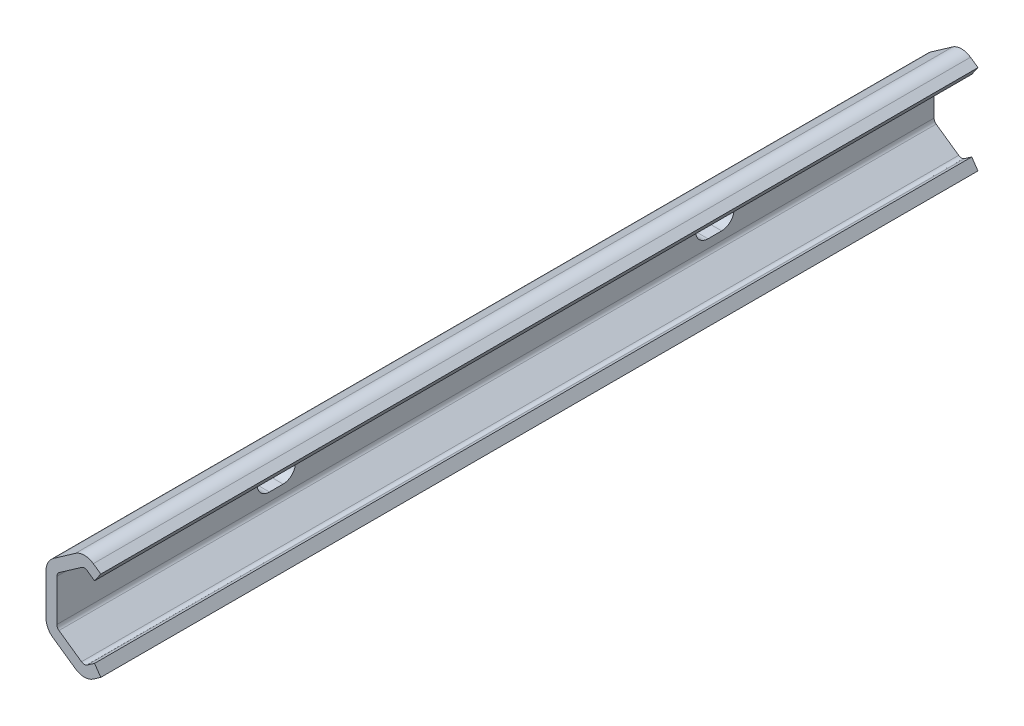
from build123d import *

# Parameters (mm, degrees)
EXTRUDE1_DEPTH  = 160
EXTRUDE2_DEPTH  = 161.489162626
LPATTERN1_COUNT = 2
LPATTERN1_PITCH = 80


with BuildPart() as part:
    # Sketch1 → Extrude1 (new body)
    with BuildSketch(Plane.XY):
        with BuildLine():
            Line((8.852847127, 6.521073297), (10, 8.159377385))
            Line((10, 8.159377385), (8.632108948, 9.117185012))
            ThreePointArc((8.632108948, 9.117185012), (7, 9.631786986), (5.367891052, 9.117185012))
            Line((5.367891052, 9.117185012), (1.382718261, 6.326736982))
            ThreePointArc((1.382718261, 6.326736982), (0.396073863, 5.224958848), (0, 3.8))
            Line((0, 3.8), (0, -3.8))
            ThreePointArc((0, -3.8), (0.368285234, -5.240165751), (1.382718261, -6.326736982))
            Line((1.382718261, -6.326736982), (5.367891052, -9.117185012))
            ThreePointArc((5.367891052, -9.117185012), (7, -9.631786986), (8.632108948, -9.117185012))
            Line((8.632108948, -9.117185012), (10, -8.159377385))
            Line((10, -8.159377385), (8.852847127, -6.521073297))
            Line((8.852847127, -6.521073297), (7.521966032, -7.452966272))
            ThreePointArc((7.521966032, -7.452966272), (7, -7.61754153), (6.478033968, -7.452966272))
            Line((6.478033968, -7.452966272), (2.369060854, -4.575832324))
            ThreePointArc((2.369060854, -4.575832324), (2.082184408, -4.236601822), (2, -3.8))
            Line((2, -3.8), (2, 3.8))
            ThreePointArc((2, 3.8), (2.096966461, 4.229570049), (2.369060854, 4.575832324))
            Line((2.369060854, 4.575832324), (6.478033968, 7.452966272))
            ThreePointArc((6.478033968, 7.452966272), (7, 7.61754153), (7.521966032, 7.452966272))
            Line((7.521966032, 7.452966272), (8.852847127, 6.521073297))
        make_face()
    extrude(amount=-EXTRUDE1_DEPTH)

    # Sketch2 → Extrude2 (cut, through all)
    with BuildSketch(Plane(origin=(2, 0, 0), x_dir=(0, 0, -1), z_dir=(1, 0, 0))):
        with BuildLine():
            Line((38.75, 2.25), (41.25, 2.25))
            ThreePointArc((41.25, 2.25), (43.5, 0), (41.25, -2.25))
            Line((41.25, -2.25), (38.75, -2.25))
            ThreePointArc((38.75, -2.25), (36.5, 0), (38.75, 2.25))
        make_face()
    extrude2 = extrude(amount=-EXTRUDE2_DEPTH, mode=Mode.SUBTRACT)

    # LPattern1: Extrude2 ×2
    with Locations(*[(0, 0, -i * LPATTERN1_PITCH) for i in range(1, LPATTERN1_COUNT)]):
        add(extrude2, mode=Mode.SUBTRACT)


solid = part.part
